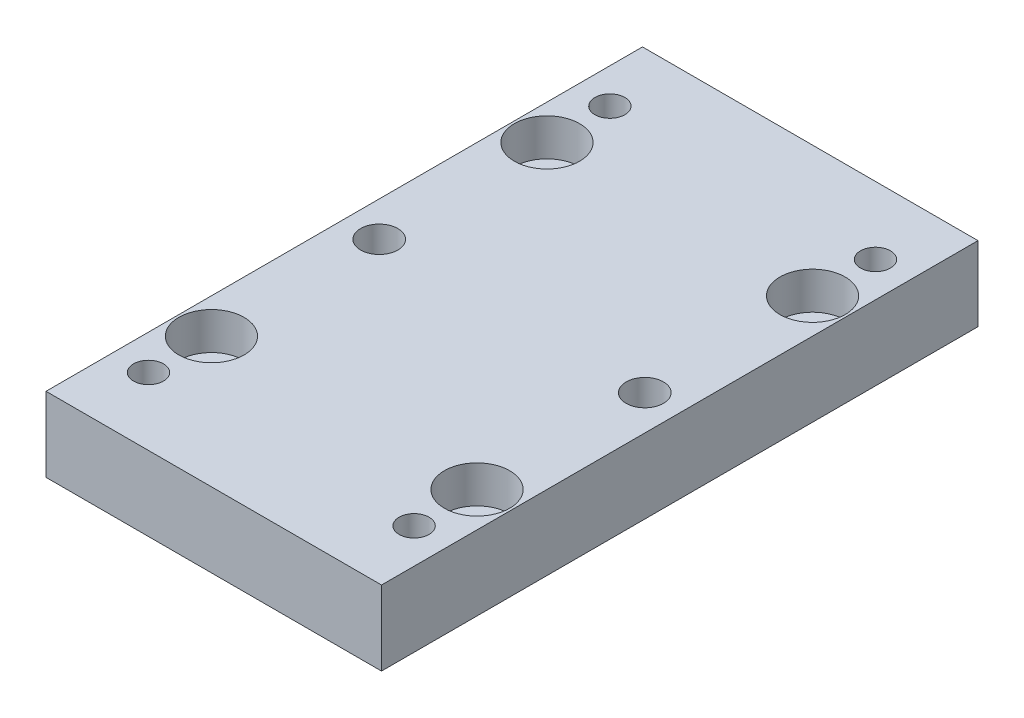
ISO-10303-21;
HEADER;
FILE_DESCRIPTION(('STEP AP214'),'2;1');
FILE_NAME('part.step','',(''),(''),'','','');
FILE_SCHEMA(('AUTOMOTIVE_DESIGN { 1 0 10303 214 1 1 1 1 }'));
ENDSEC;
DATA;
#1=APPLICATION_CONTEXT('core data for automotive mechanical design processes');
#2=APPLICATION_PROTOCOL_DEFINITION('international standard','automotive_design',2000,#1);
#3=PRODUCT_CONTEXT('',#1,'mechanical');
#4=PRODUCT('Part','Part','',(#3));
#5=PRODUCT_RELATED_PRODUCT_CATEGORY('part','',(#4));
#6=PRODUCT_DEFINITION_FORMATION('','',#4);
#7=PRODUCT_DEFINITION_CONTEXT('part definition',#1,'design');
#8=PRODUCT_DEFINITION('design','',#6,#7);
#9=PRODUCT_DEFINITION_SHAPE('','',#8);
#10=(LENGTH_UNIT() NAMED_UNIT(*) SI_UNIT(.MILLI.,.METRE.));
#11=(NAMED_UNIT(*) PLANE_ANGLE_UNIT() SI_UNIT($,.RADIAN.));
#12=(NAMED_UNIT(*) SI_UNIT($,.STERADIAN.) SOLID_ANGLE_UNIT());
#13=UNCERTAINTY_MEASURE_WITH_UNIT(LENGTH_MEASURE(1.E-05),#10,'distance_accuracy_value','');
#14=(GEOMETRIC_REPRESENTATION_CONTEXT(3) GLOBAL_UNCERTAINTY_ASSIGNED_CONTEXT((#13)) GLOBAL_UNIT_ASSIGNED_CONTEXT((#10,
#11,#12)) REPRESENTATION_CONTEXT('',''));
#15=CARTESIAN_POINT('',(0.,0.,0.));
#16=DIRECTION('',(0.,0.,1.));
#17=DIRECTION('',(1.,0.,0.));
#18=AXIS2_PLACEMENT_3D('',#15,#16,#17);
#19=CARTESIAN_POINT('',(28.575,12.7,-50.8));
#20=DIRECTION('',(-1.,0.,0.));
#21=DIRECTION('',(0.,0.,1.));
#22=AXIS2_PLACEMENT_3D('',#19,#20,#21);
#23=PLANE('',#22);
#24=DIRECTION('',(0.,0.,-1.));
#25=VECTOR('',#24,1.);
#26=CARTESIAN_POINT('',(28.575,0.,-50.8));
#27=LINE('',#26,#25);
#28=CARTESIAN_POINT('',(28.575,0.,50.8));
#29=VERTEX_POINT('',#28);
#30=CARTESIAN_POINT('',(28.575,0.,-50.8));
#31=VERTEX_POINT('',#30);
#32=EDGE_CURVE('E99',#29,#31,#27,.T.);
#33=ORIENTED_EDGE('',*,*,#32,.T.);
#34=DIRECTION('',(0.,-1.,0.));
#35=VECTOR('',#34,1.);
#36=CARTESIAN_POINT('',(28.575,12.7,-50.8));
#37=LINE('',#36,#35);
#38=CARTESIAN_POINT('',(28.575,12.7,-50.8));
#39=VERTEX_POINT('',#38);
#40=EDGE_CURVE('E11',#39,#31,#37,.T.);
#41=ORIENTED_EDGE('',*,*,#40,.F.);
#42=DIRECTION('',(0.,0.,-1.));
#43=VECTOR('',#42,1.);
#44=CARTESIAN_POINT('',(28.575,12.7,-50.8));
#45=LINE('',#44,#43);
#46=CARTESIAN_POINT('',(28.575,12.7,50.8));
#47=VERTEX_POINT('',#46);
#48=EDGE_CURVE('E87',#47,#39,#45,.T.);
#49=ORIENTED_EDGE('',*,*,#48,.F.);
#50=DIRECTION('',(0.,-1.,0.));
#51=VECTOR('',#50,1.);
#52=CARTESIAN_POINT('',(28.575,12.7,50.8));
#53=LINE('',#52,#51);
#54=EDGE_CURVE('E95',#47,#29,#53,.T.);
#55=ORIENTED_EDGE('',*,*,#54,.T.);
#56=EDGE_LOOP('',(#33,#41,#49,#55));
#57=FACE_BOUND('',#56,.T.);
#58=ADVANCED_FACE('F36',(#57),#23,.F.);
#59=CARTESIAN_POINT('',(-28.575,12.7,-50.8));
#60=DIRECTION('',(0.,0.,1.));
#61=DIRECTION('',(1.,0.,0.));
#62=AXIS2_PLACEMENT_3D('',#59,#60,#61);
#63=PLANE('',#62);
#64=DIRECTION('',(-1.,0.,0.));
#65=VECTOR('',#64,1.);
#66=CARTESIAN_POINT('',(-28.575,0.,-50.8));
#67=LINE('',#66,#65);
#68=CARTESIAN_POINT('',(-28.575,0.,-50.8));
#69=VERTEX_POINT('',#68);
#70=EDGE_CURVE('E91',#31,#69,#67,.T.);
#71=ORIENTED_EDGE('',*,*,#70,.T.);
#72=DIRECTION('',(0.,-1.,0.));
#73=VECTOR('',#72,1.);
#74=CARTESIAN_POINT('',(-28.575,12.7,-50.8));
#75=LINE('',#74,#73);
#76=CARTESIAN_POINT('',(-28.575,12.7,-50.8));
#77=VERTEX_POINT('',#76);
#78=EDGE_CURVE('E44',#77,#69,#75,.T.);
#79=ORIENTED_EDGE('',*,*,#78,.F.);
#80=DIRECTION('',(-1.,0.,0.));
#81=VECTOR('',#80,1.);
#82=CARTESIAN_POINT('',(-28.575,12.7,-50.8));
#83=LINE('',#82,#81);
#84=EDGE_CURVE('E82',#39,#77,#83,.T.);
#85=ORIENTED_EDGE('',*,*,#84,.F.);
#86=ORIENTED_EDGE('',*,*,#40,.T.);
#87=EDGE_LOOP('',(#71,#79,#85,#86));
#88=FACE_BOUND('',#87,.T.);
#89=ADVANCED_FACE('F90',(#88),#63,.F.);
#90=CARTESIAN_POINT('',(-28.575,12.7,-50.8));
#91=DIRECTION('',(1.,0.,0.));
#92=DIRECTION('',(0.,0.,-1.));
#93=AXIS2_PLACEMENT_3D('',#90,#91,#92);
#94=PLANE('',#93);
#95=DIRECTION('',(0.,0.,1.));
#96=VECTOR('',#95,1.);
#97=CARTESIAN_POINT('',(-28.575,0.,-50.8));
#98=LINE('',#97,#96);
#99=CARTESIAN_POINT('',(-28.575,0.,50.8));
#100=VERTEX_POINT('',#99);
#101=EDGE_CURVE('E69',#69,#100,#98,.T.);
#102=ORIENTED_EDGE('',*,*,#101,.T.);
#103=DIRECTION('',(0.,-1.,0.));
#104=VECTOR('',#103,1.);
#105=CARTESIAN_POINT('',(-28.575,12.7,50.8));
#106=LINE('',#105,#104);
#107=CARTESIAN_POINT('',(-28.575,12.7,50.8));
#108=VERTEX_POINT('',#107);
#109=EDGE_CURVE('E92',#108,#100,#106,.T.);
#110=ORIENTED_EDGE('',*,*,#109,.F.);
#111=DIRECTION('',(0.,0.,1.));
#112=VECTOR('',#111,1.);
#113=CARTESIAN_POINT('',(-28.575,12.7,-50.8));
#114=LINE('',#113,#112);
#115=EDGE_CURVE('E85',#77,#108,#114,.T.);
#116=ORIENTED_EDGE('',*,*,#115,.F.);
#117=ORIENTED_EDGE('',*,*,#78,.T.);
#118=EDGE_LOOP('',(#102,#110,#116,#117));
#119=FACE_BOUND('',#118,.T.);
#120=ADVANCED_FACE('F93',(#119),#94,.F.);
#121=CARTESIAN_POINT('',(-28.575,12.7,50.8));
#122=DIRECTION('',(0.,0.,-1.));
#123=DIRECTION('',(-1.,0.,0.));
#124=AXIS2_PLACEMENT_3D('',#121,#122,#123);
#125=PLANE('',#124);
#126=DIRECTION('',(1.,0.,0.));
#127=VECTOR('',#126,1.);
#128=CARTESIAN_POINT('',(-28.575,0.,50.8));
#129=LINE('',#128,#127);
#130=EDGE_CURVE('E75',#100,#29,#129,.T.);
#131=ORIENTED_EDGE('',*,*,#130,.T.);
#132=ORIENTED_EDGE('',*,*,#54,.F.);
#133=DIRECTION('',(1.,0.,0.));
#134=VECTOR('',#133,1.);
#135=CARTESIAN_POINT('',(-28.575,12.7,50.8));
#136=LINE('',#135,#134);
#137=EDGE_CURVE('E52',#108,#47,#136,.T.);
#138=ORIENTED_EDGE('',*,*,#137,.F.);
#139=ORIENTED_EDGE('',*,*,#109,.T.);
#140=EDGE_LOOP('',(#131,#132,#138,#139));
#141=FACE_BOUND('',#140,.T.);
#142=ADVANCED_FACE('F107',(#141),#125,.F.);
#143=CARTESIAN_POINT('',(0.,12.7,0.));
#144=DIRECTION('',(0.,1.,0.));
#145=DIRECTION('',(0.,0.,1.));
#146=AXIS2_PLACEMENT_3D('',#143,#144,#145);
#147=PLANE('',#146);
#148=CARTESIAN_POINT('',(-22.6187,12.7,39.2937999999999));
#149=DIRECTION('',(0.,1.,0.));
#150=DIRECTION('',(0.,0.,1.));
#151=AXIS2_PLACEMENT_3D('',#148,#149,#150);
#152=CIRCLE('',#151,2.5527);
#153=CARTESIAN_POINT('',(-22.6187,12.7,41.8464999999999));
#154=VERTEX_POINT('',#153);
#155=EDGE_CURVE('E193',#154,#154,#152,.T.);
#156=ORIENTED_EDGE('',*,*,#155,.F.);
#157=EDGE_LOOP('',(#156));
#158=FACE_BOUND('',#157,.T.);
#159=CARTESIAN_POINT('',(22.6187,12.7,39.2937999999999));
#160=DIRECTION('',(0.,1.,0.));
#161=DIRECTION('',(0.,0.,1.));
#162=AXIS2_PLACEMENT_3D('',#159,#160,#161);
#163=CIRCLE('',#162,2.5527);
#164=CARTESIAN_POINT('',(22.6187,12.7,41.8464999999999));
#165=VERTEX_POINT('',#164);
#166=EDGE_CURVE('E187',#165,#165,#163,.T.);
#167=ORIENTED_EDGE('',*,*,#166,.F.);
#168=EDGE_LOOP('',(#167));
#169=FACE_BOUND('',#168,.T.);
#170=CARTESIAN_POINT('',(-22.6187,12.7,-39.2938));
#171=DIRECTION('',(0.,1.,0.));
#172=DIRECTION('',(0.,0.,1.));
#173=AXIS2_PLACEMENT_3D('',#170,#171,#172);
#174=CIRCLE('',#173,2.5527);
#175=CARTESIAN_POINT('',(-22.6187,12.7,-36.7411));
#176=VERTEX_POINT('',#175);
#177=EDGE_CURVE('E181',#176,#176,#174,.T.);
#178=ORIENTED_EDGE('',*,*,#177,.F.);
#179=EDGE_LOOP('',(#178));
#180=FACE_BOUND('',#179,.T.);
#181=CARTESIAN_POINT('',(22.6187,12.7,-39.2938));
#182=DIRECTION('',(0.,1.,0.));
#183=DIRECTION('',(0.,0.,1.));
#184=AXIS2_PLACEMENT_3D('',#181,#182,#183);
#185=CIRCLE('',#184,2.5527);
#186=CARTESIAN_POINT('',(22.6187,12.7,-36.7411));
#187=VERTEX_POINT('',#186);
#188=EDGE_CURVE('E175',#187,#187,#185,.T.);
#189=ORIENTED_EDGE('',*,*,#188,.F.);
#190=EDGE_LOOP('',(#189));
#191=FACE_BOUND('',#190,.T.);
#192=CARTESIAN_POINT('',(22.6187,12.7,0.));
#193=DIRECTION('',(0.,1.,0.));
#194=DIRECTION('',(0.,0.,1.));
#195=AXIS2_PLACEMENT_3D('',#192,#193,#194);
#196=CIRCLE('',#195,3.175);
#197=CARTESIAN_POINT('',(22.6187,12.7,3.175));
#198=VERTEX_POINT('',#197);
#199=EDGE_CURVE('E169',#198,#198,#196,.T.);
#200=ORIENTED_EDGE('',*,*,#199,.F.);
#201=EDGE_LOOP('',(#200));
#202=FACE_BOUND('',#201,.T.);
#203=CARTESIAN_POINT('',(-22.6187,12.7,0.));
#204=DIRECTION('',(0.,1.,0.));
#205=DIRECTION('',(0.,0.,1.));
#206=AXIS2_PLACEMENT_3D('',#203,#204,#205);
#207=CIRCLE('',#206,3.175);
#208=CARTESIAN_POINT('',(-22.6187,12.7,3.175));
#209=VERTEX_POINT('',#208);
#210=EDGE_CURVE('E163',#209,#209,#207,.T.);
#211=ORIENTED_EDGE('',*,*,#210,.F.);
#212=EDGE_LOOP('',(#211));
#213=FACE_BOUND('',#212,.T.);
#214=CARTESIAN_POINT('',(22.6187,12.7,28.575));
#215=DIRECTION('',(0.,1.,0.));
#216=DIRECTION('',(0.,0.,1.));
#217=AXIS2_PLACEMENT_3D('',#214,#215,#216);
#218=CIRCLE('',#217,5.55625);
#219=CARTESIAN_POINT('',(22.6187,12.7,34.13125));
#220=VERTEX_POINT('',#219);
#221=EDGE_CURVE('E157',#220,#220,#218,.T.);
#222=ORIENTED_EDGE('',*,*,#221,.F.);
#223=EDGE_LOOP('',(#222));
#224=FACE_BOUND('',#223,.T.);
#225=CARTESIAN_POINT('',(22.6187,12.7,-28.575));
#226=DIRECTION('',(0.,1.,0.));
#227=DIRECTION('',(0.,0.,1.));
#228=AXIS2_PLACEMENT_3D('',#225,#226,#227);
#229=CIRCLE('',#228,5.55625);
#230=CARTESIAN_POINT('',(22.6187,12.7,-23.01875));
#231=VERTEX_POINT('',#230);
#232=EDGE_CURVE('E145',#231,#231,#229,.T.);
#233=ORIENTED_EDGE('',*,*,#232,.F.);
#234=EDGE_LOOP('',(#233));
#235=FACE_BOUND('',#234,.T.);
#236=CARTESIAN_POINT('',(-22.6187,12.7,-28.575));
#237=DIRECTION('',(0.,1.,0.));
#238=DIRECTION('',(0.,0.,1.));
#239=AXIS2_PLACEMENT_3D('',#236,#237,#238);
#240=CIRCLE('',#239,5.55625);
#241=CARTESIAN_POINT('',(-22.6187,12.7,-23.01875));
#242=VERTEX_POINT('',#241);
#243=EDGE_CURVE('E133',#242,#242,#240,.T.);
#244=ORIENTED_EDGE('',*,*,#243,.F.);
#245=EDGE_LOOP('',(#244));
#246=FACE_BOUND('',#245,.T.);
#247=CARTESIAN_POINT('',(-22.6187,12.7,28.575));
#248=DIRECTION('',(0.,1.,0.));
#249=DIRECTION('',(0.,0.,1.));
#250=AXIS2_PLACEMENT_3D('',#247,#248,#249);
#251=CIRCLE('',#250,5.55625);
#252=CARTESIAN_POINT('',(-22.6187,12.7,34.13125));
#253=VERTEX_POINT('',#252);
#254=EDGE_CURVE('E121',#253,#253,#251,.T.);
#255=ORIENTED_EDGE('',*,*,#254,.F.);
#256=EDGE_LOOP('',(#255));
#257=FACE_BOUND('',#256,.T.);
#258=ORIENTED_EDGE('',*,*,#48,.T.);
#259=ORIENTED_EDGE('',*,*,#84,.T.);
#260=ORIENTED_EDGE('',*,*,#115,.T.);
#261=ORIENTED_EDGE('',*,*,#137,.T.);
#262=EDGE_LOOP('',(#258,#259,#260,#261));
#263=FACE_BOUND('',#262,.T.);
#264=ADVANCED_FACE('F83',(#158,#169,#180,#191,#202,#213,#224,#235,#246,#257,#263),#147,.T.);
#265=CARTESIAN_POINT('',(0.,0.,0.));
#266=DIRECTION('',(0.,1.,0.));
#267=DIRECTION('',(0.,0.,1.));
#268=AXIS2_PLACEMENT_3D('',#265,#266,#267);
#269=PLANE('',#268);
#270=CARTESIAN_POINT('',(-22.6187,0.,39.2937999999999));
#271=DIRECTION('',(0.,1.,0.));
#272=DIRECTION('',(0.,0.,1.));
#273=AXIS2_PLACEMENT_3D('',#270,#271,#272);
#274=CIRCLE('',#273,2.5527);
#275=CARTESIAN_POINT('',(-22.6187,0.,41.8464999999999));
#276=VERTEX_POINT('',#275);
#277=EDGE_CURVE('E190',#276,#276,#274,.T.);
#278=ORIENTED_EDGE('',*,*,#277,.T.);
#279=EDGE_LOOP('',(#278));
#280=FACE_BOUND('',#279,.T.);
#281=CARTESIAN_POINT('',(22.6187,0.,39.2937999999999));
#282=DIRECTION('',(0.,1.,0.));
#283=DIRECTION('',(0.,0.,1.));
#284=AXIS2_PLACEMENT_3D('',#281,#282,#283);
#285=CIRCLE('',#284,2.5527);
#286=CARTESIAN_POINT('',(22.6187,0.,41.8464999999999));
#287=VERTEX_POINT('',#286);
#288=EDGE_CURVE('E184',#287,#287,#285,.T.);
#289=ORIENTED_EDGE('',*,*,#288,.T.);
#290=EDGE_LOOP('',(#289));
#291=FACE_BOUND('',#290,.T.);
#292=CARTESIAN_POINT('',(-22.6187,0.,-39.2938));
#293=DIRECTION('',(0.,1.,0.));
#294=DIRECTION('',(0.,0.,1.));
#295=AXIS2_PLACEMENT_3D('',#292,#293,#294);
#296=CIRCLE('',#295,2.5527);
#297=CARTESIAN_POINT('',(-22.6187,0.,-36.7411));
#298=VERTEX_POINT('',#297);
#299=EDGE_CURVE('E178',#298,#298,#296,.T.);
#300=ORIENTED_EDGE('',*,*,#299,.T.);
#301=EDGE_LOOP('',(#300));
#302=FACE_BOUND('',#301,.T.);
#303=CARTESIAN_POINT('',(22.6187,0.,-39.2938));
#304=DIRECTION('',(0.,1.,0.));
#305=DIRECTION('',(0.,0.,1.));
#306=AXIS2_PLACEMENT_3D('',#303,#304,#305);
#307=CIRCLE('',#306,2.5527);
#308=CARTESIAN_POINT('',(22.6187,0.,-36.7411));
#309=VERTEX_POINT('',#308);
#310=EDGE_CURVE('E172',#309,#309,#307,.T.);
#311=ORIENTED_EDGE('',*,*,#310,.T.);
#312=EDGE_LOOP('',(#311));
#313=FACE_BOUND('',#312,.T.);
#314=CARTESIAN_POINT('',(22.6187,0.,0.));
#315=DIRECTION('',(0.,1.,0.));
#316=DIRECTION('',(0.,0.,1.));
#317=AXIS2_PLACEMENT_3D('',#314,#315,#316);
#318=CIRCLE('',#317,3.175);
#319=CARTESIAN_POINT('',(22.6187,0.,3.175));
#320=VERTEX_POINT('',#319);
#321=EDGE_CURVE('E166',#320,#320,#318,.T.);
#322=ORIENTED_EDGE('',*,*,#321,.T.);
#323=EDGE_LOOP('',(#322));
#324=FACE_BOUND('',#323,.T.);
#325=CARTESIAN_POINT('',(-22.6187,0.,0.));
#326=DIRECTION('',(0.,1.,0.));
#327=DIRECTION('',(0.,0.,1.));
#328=AXIS2_PLACEMENT_3D('',#325,#326,#327);
#329=CIRCLE('',#328,3.175);
#330=CARTESIAN_POINT('',(-22.6187,0.,3.175));
#331=VERTEX_POINT('',#330);
#332=EDGE_CURVE('E160',#331,#331,#329,.T.);
#333=ORIENTED_EDGE('',*,*,#332,.T.);
#334=EDGE_LOOP('',(#333));
#335=FACE_BOUND('',#334,.T.);
#336=CARTESIAN_POINT('',(22.6187,0.,28.575));
#337=DIRECTION('',(0.,1.,0.));
#338=DIRECTION('',(0.,0.,1.));
#339=AXIS2_PLACEMENT_3D('',#336,#337,#338);
#340=CIRCLE('',#339,3.3782);
#341=CARTESIAN_POINT('',(22.6187,0.,31.9532));
#342=VERTEX_POINT('',#341);
#343=EDGE_CURVE('E148',#342,#342,#340,.T.);
#344=ORIENTED_EDGE('',*,*,#343,.T.);
#345=EDGE_LOOP('',(#344));
#346=FACE_BOUND('',#345,.T.);
#347=CARTESIAN_POINT('',(22.6187,0.,-28.575));
#348=DIRECTION('',(0.,1.,0.));
#349=DIRECTION('',(0.,0.,1.));
#350=AXIS2_PLACEMENT_3D('',#347,#348,#349);
#351=CIRCLE('',#350,3.3782);
#352=CARTESIAN_POINT('',(22.6187,0.,-25.1968));
#353=VERTEX_POINT('',#352);
#354=EDGE_CURVE('E136',#353,#353,#351,.T.);
#355=ORIENTED_EDGE('',*,*,#354,.T.);
#356=EDGE_LOOP('',(#355));
#357=FACE_BOUND('',#356,.T.);
#358=CARTESIAN_POINT('',(-22.6187,0.,-28.575));
#359=DIRECTION('',(0.,1.,0.));
#360=DIRECTION('',(0.,0.,1.));
#361=AXIS2_PLACEMENT_3D('',#358,#359,#360);
#362=CIRCLE('',#361,3.3782);
#363=CARTESIAN_POINT('',(-22.6187,0.,-25.1968));
#364=VERTEX_POINT('',#363);
#365=EDGE_CURVE('E124',#364,#364,#362,.T.);
#366=ORIENTED_EDGE('',*,*,#365,.T.);
#367=EDGE_LOOP('',(#366));
#368=FACE_BOUND('',#367,.T.);
#369=CARTESIAN_POINT('',(-22.6187,0.,28.575));
#370=DIRECTION('',(0.,1.,0.));
#371=DIRECTION('',(0.,0.,1.));
#372=AXIS2_PLACEMENT_3D('',#369,#370,#371);
#373=CIRCLE('',#372,3.3782);
#374=CARTESIAN_POINT('',(-22.6187,0.,31.9532));
#375=VERTEX_POINT('',#374);
#376=EDGE_CURVE('E102',#375,#375,#373,.T.);
#377=ORIENTED_EDGE('',*,*,#376,.T.);
#378=EDGE_LOOP('',(#377));
#379=FACE_BOUND('',#378,.T.);
#380=ORIENTED_EDGE('',*,*,#32,.F.);
#381=ORIENTED_EDGE('',*,*,#130,.F.);
#382=ORIENTED_EDGE('',*,*,#101,.F.);
#383=ORIENTED_EDGE('',*,*,#70,.F.);
#384=EDGE_LOOP('',(#380,#381,#382,#383));
#385=FACE_BOUND('',#384,.T.);
#386=ADVANCED_FACE('F110',(#280,#291,#302,#313,#324,#335,#346,#357,#368,#379,#385),#269,.F.);
#387=CARTESIAN_POINT('',(-22.6187,12.7,28.575));
#388=DIRECTION('',(0.,1.,0.));
#389=DIRECTION('',(0.,0.,1.));
#390=AXIS2_PLACEMENT_3D('',#387,#388,#389);
#391=CYLINDRICAL_SURFACE('',#390,3.3782);
#392=ORIENTED_EDGE('',*,*,#376,.F.);
#393=EDGE_LOOP('',(#392));
#394=FACE_BOUND('',#393,.T.);
#395=CARTESIAN_POINT('',(-22.6187,6.35,28.575));
#396=DIRECTION('',(0.,1.,0.));
#397=DIRECTION('',(0.,0.,1.));
#398=AXIS2_PLACEMENT_3D('',#395,#396,#397);
#399=CIRCLE('',#398,3.3782);
#400=CARTESIAN_POINT('',(-22.6187,6.35,31.9532));
#401=VERTEX_POINT('',#400);
#402=EDGE_CURVE('E115',#401,#401,#399,.T.);
#403=ORIENTED_EDGE('',*,*,#402,.T.);
#404=EDGE_LOOP('',(#403));
#405=FACE_BOUND('',#404,.T.);
#406=ADVANCED_FACE('F233',(#394,#405),#391,.F.);
#407=CARTESIAN_POINT('',(-19.2405,6.35,28.575));
#408=DIRECTION('',(0.,-1.,0.));
#409=DIRECTION('',(0.,0.,-1.));
#410=AXIS2_PLACEMENT_3D('',#407,#408,#409);
#411=PLANE('',#410);
#412=ORIENTED_EDGE('',*,*,#402,.F.);
#413=EDGE_LOOP('',(#412));
#414=FACE_BOUND('',#413,.T.);
#415=CARTESIAN_POINT('',(-22.6187,6.35,28.575));
#416=DIRECTION('',(0.,1.,0.));
#417=DIRECTION('',(0.,0.,1.));
#418=AXIS2_PLACEMENT_3D('',#415,#416,#417);
#419=CIRCLE('',#418,5.55625);
#420=CARTESIAN_POINT('',(-22.6187,6.35,34.13125));
#421=VERTEX_POINT('',#420);
#422=EDGE_CURVE('E118',#421,#421,#419,.T.);
#423=ORIENTED_EDGE('',*,*,#422,.T.);
#424=EDGE_LOOP('',(#423));
#425=FACE_BOUND('',#424,.T.);
#426=ADVANCED_FACE('F223',(#414,#425),#411,.F.);
#427=CARTESIAN_POINT('',(-22.6187,12.7,28.575));
#428=DIRECTION('',(0.,1.,0.));
#429=DIRECTION('',(0.,0.,1.));
#430=AXIS2_PLACEMENT_3D('',#427,#428,#429);
#431=CYLINDRICAL_SURFACE('',#430,5.55625);
#432=ORIENTED_EDGE('',*,*,#422,.F.);
#433=EDGE_LOOP('',(#432));
#434=FACE_BOUND('',#433,.T.);
#435=ORIENTED_EDGE('',*,*,#254,.T.);
#436=EDGE_LOOP('',(#435));
#437=FACE_BOUND('',#436,.T.);
#438=ADVANCED_FACE('F220',(#434,#437),#431,.F.);
#439=CARTESIAN_POINT('',(-22.6187,12.7,-28.575));
#440=DIRECTION('',(0.,1.,0.));
#441=DIRECTION('',(0.,0.,1.));
#442=AXIS2_PLACEMENT_3D('',#439,#440,#441);
#443=CYLINDRICAL_SURFACE('',#442,3.3782);
#444=ORIENTED_EDGE('',*,*,#365,.F.);
#445=EDGE_LOOP('',(#444));
#446=FACE_BOUND('',#445,.T.);
#447=CARTESIAN_POINT('',(-22.6187,6.35,-28.575));
#448=DIRECTION('',(0.,1.,0.));
#449=DIRECTION('',(0.,0.,1.));
#450=AXIS2_PLACEMENT_3D('',#447,#448,#449);
#451=CIRCLE('',#450,3.3782);
#452=CARTESIAN_POINT('',(-22.6187,6.35,-25.1968));
#453=VERTEX_POINT('',#452);
#454=EDGE_CURVE('E127',#453,#453,#451,.T.);
#455=ORIENTED_EDGE('',*,*,#454,.T.);
#456=EDGE_LOOP('',(#455));
#457=FACE_BOUND('',#456,.T.);
#458=ADVANCED_FACE('F222',(#446,#457),#443,.F.);
#459=CARTESIAN_POINT('',(-19.2405,6.35,-28.575));
#460=DIRECTION('',(0.,-1.,0.));
#461=DIRECTION('',(0.,0.,-1.));
#462=AXIS2_PLACEMENT_3D('',#459,#460,#461);
#463=PLANE('',#462);
#464=ORIENTED_EDGE('',*,*,#454,.F.);
#465=EDGE_LOOP('',(#464));
#466=FACE_BOUND('',#465,.T.);
#467=CARTESIAN_POINT('',(-22.6187,6.35,-28.575));
#468=DIRECTION('',(0.,1.,0.));
#469=DIRECTION('',(0.,0.,1.));
#470=AXIS2_PLACEMENT_3D('',#467,#468,#469);
#471=CIRCLE('',#470,5.55625);
#472=CARTESIAN_POINT('',(-22.6187,6.35,-23.01875));
#473=VERTEX_POINT('',#472);
#474=EDGE_CURVE('E130',#473,#473,#471,.T.);
#475=ORIENTED_EDGE('',*,*,#474,.T.);
#476=EDGE_LOOP('',(#475));
#477=FACE_BOUND('',#476,.T.);
#478=ADVANCED_FACE('F230',(#466,#477),#463,.F.);
#479=CARTESIAN_POINT('',(-22.6187,12.7,-28.575));
#480=DIRECTION('',(0.,1.,0.));
#481=DIRECTION('',(0.,0.,1.));
#482=AXIS2_PLACEMENT_3D('',#479,#480,#481);
#483=CYLINDRICAL_SURFACE('',#482,5.55625);
#484=ORIENTED_EDGE('',*,*,#474,.F.);
#485=EDGE_LOOP('',(#484));
#486=FACE_BOUND('',#485,.T.);
#487=ORIENTED_EDGE('',*,*,#243,.T.);
#488=EDGE_LOOP('',(#487));
#489=FACE_BOUND('',#488,.T.);
#490=ADVANCED_FACE('F286',(#486,#489),#483,.F.);
#491=CARTESIAN_POINT('',(22.6187,12.7,-28.575));
#492=DIRECTION('',(0.,1.,0.));
#493=DIRECTION('',(0.,0.,1.));
#494=AXIS2_PLACEMENT_3D('',#491,#492,#493);
#495=CYLINDRICAL_SURFACE('',#494,3.3782);
#496=ORIENTED_EDGE('',*,*,#354,.F.);
#497=EDGE_LOOP('',(#496));
#498=FACE_BOUND('',#497,.T.);
#499=CARTESIAN_POINT('',(22.6187,6.35,-28.575));
#500=DIRECTION('',(0.,1.,0.));
#501=DIRECTION('',(0.,0.,1.));
#502=AXIS2_PLACEMENT_3D('',#499,#500,#501);
#503=CIRCLE('',#502,3.3782);
#504=CARTESIAN_POINT('',(22.6187,6.35,-25.1968));
#505=VERTEX_POINT('',#504);
#506=EDGE_CURVE('E139',#505,#505,#503,.T.);
#507=ORIENTED_EDGE('',*,*,#506,.T.);
#508=EDGE_LOOP('',(#507));
#509=FACE_BOUND('',#508,.T.);
#510=ADVANCED_FACE('F296',(#498,#509),#495,.F.);
#511=CARTESIAN_POINT('',(25.9969,6.35,-28.575));
#512=DIRECTION('',(0.,-1.,0.));
#513=DIRECTION('',(0.,0.,-1.));
#514=AXIS2_PLACEMENT_3D('',#511,#512,#513);
#515=PLANE('',#514);
#516=ORIENTED_EDGE('',*,*,#506,.F.);
#517=EDGE_LOOP('',(#516));
#518=FACE_BOUND('',#517,.T.);
#519=CARTESIAN_POINT('',(22.6187,6.35,-28.575));
#520=DIRECTION('',(0.,1.,0.));
#521=DIRECTION('',(0.,0.,1.));
#522=AXIS2_PLACEMENT_3D('',#519,#520,#521);
#523=CIRCLE('',#522,5.55625);
#524=CARTESIAN_POINT('',(22.6187,6.35,-23.01875));
#525=VERTEX_POINT('',#524);
#526=EDGE_CURVE('E142',#525,#525,#523,.T.);
#527=ORIENTED_EDGE('',*,*,#526,.T.);
#528=EDGE_LOOP('',(#527));
#529=FACE_BOUND('',#528,.T.);
#530=ADVANCED_FACE('F306',(#518,#529),#515,.F.);
#531=CARTESIAN_POINT('',(22.6187,12.7,-28.575));
#532=DIRECTION('',(0.,1.,0.));
#533=DIRECTION('',(0.,0.,1.));
#534=AXIS2_PLACEMENT_3D('',#531,#532,#533);
#535=CYLINDRICAL_SURFACE('',#534,5.55625);
#536=ORIENTED_EDGE('',*,*,#526,.F.);
#537=EDGE_LOOP('',(#536));
#538=FACE_BOUND('',#537,.T.);
#539=ORIENTED_EDGE('',*,*,#232,.T.);
#540=EDGE_LOOP('',(#539));
#541=FACE_BOUND('',#540,.T.);
#542=ADVANCED_FACE('F316',(#538,#541),#535,.F.);
#543=CARTESIAN_POINT('',(22.6187,12.7,28.575));
#544=DIRECTION('',(0.,1.,0.));
#545=DIRECTION('',(0.,0.,1.));
#546=AXIS2_PLACEMENT_3D('',#543,#544,#545);
#547=CYLINDRICAL_SURFACE('',#546,3.3782);
#548=ORIENTED_EDGE('',*,*,#343,.F.);
#549=EDGE_LOOP('',(#548));
#550=FACE_BOUND('',#549,.T.);
#551=CARTESIAN_POINT('',(22.6187,6.35,28.575));
#552=DIRECTION('',(0.,1.,0.));
#553=DIRECTION('',(0.,0.,1.));
#554=AXIS2_PLACEMENT_3D('',#551,#552,#553);
#555=CIRCLE('',#554,3.3782);
#556=CARTESIAN_POINT('',(22.6187,6.35,31.9532));
#557=VERTEX_POINT('',#556);
#558=EDGE_CURVE('E151',#557,#557,#555,.T.);
#559=ORIENTED_EDGE('',*,*,#558,.T.);
#560=EDGE_LOOP('',(#559));
#561=FACE_BOUND('',#560,.T.);
#562=ADVANCED_FACE('F326',(#550,#561),#547,.F.);
#563=CARTESIAN_POINT('',(25.9969,6.35,28.575));
#564=DIRECTION('',(0.,-1.,0.));
#565=DIRECTION('',(0.,0.,-1.));
#566=AXIS2_PLACEMENT_3D('',#563,#564,#565);
#567=PLANE('',#566);
#568=ORIENTED_EDGE('',*,*,#558,.F.);
#569=EDGE_LOOP('',(#568));
#570=FACE_BOUND('',#569,.T.);
#571=CARTESIAN_POINT('',(22.6187,6.35,28.575));
#572=DIRECTION('',(0.,1.,0.));
#573=DIRECTION('',(0.,0.,1.));
#574=AXIS2_PLACEMENT_3D('',#571,#572,#573);
#575=CIRCLE('',#574,5.55625);
#576=CARTESIAN_POINT('',(22.6187,6.35,34.13125));
#577=VERTEX_POINT('',#576);
#578=EDGE_CURVE('E154',#577,#577,#575,.T.);
#579=ORIENTED_EDGE('',*,*,#578,.T.);
#580=EDGE_LOOP('',(#579));
#581=FACE_BOUND('',#580,.T.);
#582=ADVANCED_FACE('F336',(#570,#581),#567,.F.);
#583=CARTESIAN_POINT('',(22.6187,12.7,28.575));
#584=DIRECTION('',(0.,1.,0.));
#585=DIRECTION('',(0.,0.,1.));
#586=AXIS2_PLACEMENT_3D('',#583,#584,#585);
#587=CYLINDRICAL_SURFACE('',#586,5.55625);
#588=ORIENTED_EDGE('',*,*,#578,.F.);
#589=EDGE_LOOP('',(#588));
#590=FACE_BOUND('',#589,.T.);
#591=ORIENTED_EDGE('',*,*,#221,.T.);
#592=EDGE_LOOP('',(#591));
#593=FACE_BOUND('',#592,.T.);
#594=ADVANCED_FACE('F346',(#590,#593),#587,.F.);
#595=CARTESIAN_POINT('',(-22.6187,12.7,0.));
#596=DIRECTION('',(0.,1.,0.));
#597=DIRECTION('',(0.,0.,1.));
#598=AXIS2_PLACEMENT_3D('',#595,#596,#597);
#599=CYLINDRICAL_SURFACE('',#598,3.175);
#600=ORIENTED_EDGE('',*,*,#332,.F.);
#601=EDGE_LOOP('',(#600));
#602=FACE_BOUND('',#601,.T.);
#603=ORIENTED_EDGE('',*,*,#210,.T.);
#604=EDGE_LOOP('',(#603));
#605=FACE_BOUND('',#604,.T.);
#606=ADVANCED_FACE('F356',(#602,#605),#599,.F.);
#607=CARTESIAN_POINT('',(22.6187,12.7,0.));
#608=DIRECTION('',(0.,1.,0.));
#609=DIRECTION('',(0.,0.,1.));
#610=AXIS2_PLACEMENT_3D('',#607,#608,#609);
#611=CYLINDRICAL_SURFACE('',#610,3.175);
#612=ORIENTED_EDGE('',*,*,#321,.F.);
#613=EDGE_LOOP('',(#612));
#614=FACE_BOUND('',#613,.T.);
#615=ORIENTED_EDGE('',*,*,#199,.T.);
#616=EDGE_LOOP('',(#615));
#617=FACE_BOUND('',#616,.T.);
#618=ADVANCED_FACE('F366',(#614,#617),#611,.F.);
#619=CARTESIAN_POINT('',(22.6187,12.7,-39.2938));
#620=DIRECTION('',(0.,1.,0.));
#621=DIRECTION('',(0.,0.,1.));
#622=AXIS2_PLACEMENT_3D('',#619,#620,#621);
#623=CYLINDRICAL_SURFACE('',#622,2.5527);
#624=ORIENTED_EDGE('',*,*,#310,.F.);
#625=EDGE_LOOP('',(#624));
#626=FACE_BOUND('',#625,.T.);
#627=ORIENTED_EDGE('',*,*,#188,.T.);
#628=EDGE_LOOP('',(#627));
#629=FACE_BOUND('',#628,.T.);
#630=ADVANCED_FACE('F376',(#626,#629),#623,.F.);
#631=CARTESIAN_POINT('',(-22.6187,12.7,-39.2938));
#632=DIRECTION('',(0.,1.,0.));
#633=DIRECTION('',(0.,0.,1.));
#634=AXIS2_PLACEMENT_3D('',#631,#632,#633);
#635=CYLINDRICAL_SURFACE('',#634,2.5527);
#636=ORIENTED_EDGE('',*,*,#299,.F.);
#637=EDGE_LOOP('',(#636));
#638=FACE_BOUND('',#637,.T.);
#639=ORIENTED_EDGE('',*,*,#177,.T.);
#640=EDGE_LOOP('',(#639));
#641=FACE_BOUND('',#640,.T.);
#642=ADVANCED_FACE('F398',(#638,#641),#635,.F.);
#643=CARTESIAN_POINT('',(22.6187,12.7,39.2937999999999));
#644=DIRECTION('',(0.,1.,0.));
#645=DIRECTION('',(0.,0.,1.));
#646=AXIS2_PLACEMENT_3D('',#643,#644,#645);
#647=CYLINDRICAL_SURFACE('',#646,2.5527);
#648=ORIENTED_EDGE('',*,*,#288,.F.);
#649=EDGE_LOOP('',(#648));
#650=FACE_BOUND('',#649,.T.);
#651=ORIENTED_EDGE('',*,*,#166,.T.);
#652=EDGE_LOOP('',(#651));
#653=FACE_BOUND('',#652,.T.);
#654=ADVANCED_FACE('F409',(#650,#653),#647,.F.);
#655=CARTESIAN_POINT('',(-22.6187,12.7,39.2937999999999));
#656=DIRECTION('',(0.,1.,0.));
#657=DIRECTION('',(0.,0.,1.));
#658=AXIS2_PLACEMENT_3D('',#655,#656,#657);
#659=CYLINDRICAL_SURFACE('',#658,2.5527);
#660=ORIENTED_EDGE('',*,*,#277,.F.);
#661=EDGE_LOOP('',(#660));
#662=FACE_BOUND('',#661,.T.);
#663=ORIENTED_EDGE('',*,*,#155,.T.);
#664=EDGE_LOOP('',(#663));
#665=FACE_BOUND('',#664,.T.);
#666=ADVANCED_FACE('F197',(#662,#665),#659,.F.);
#667=CLOSED_SHELL('',(#58,#89,#120,#142,#264,#386,#406,#426,#438,#458,#478,#490,#510,#530,#542,
#562,#582,#594,#606,#618,#630,#642,#654,#666));
#668=MANIFOLD_SOLID_BREP('B2',#667);
#669=ADVANCED_BREP_SHAPE_REPRESENTATION('',(#18,#668),#14);
#670=SHAPE_DEFINITION_REPRESENTATION(#9,#669);
ENDSEC;
END-ISO-10303-21;
